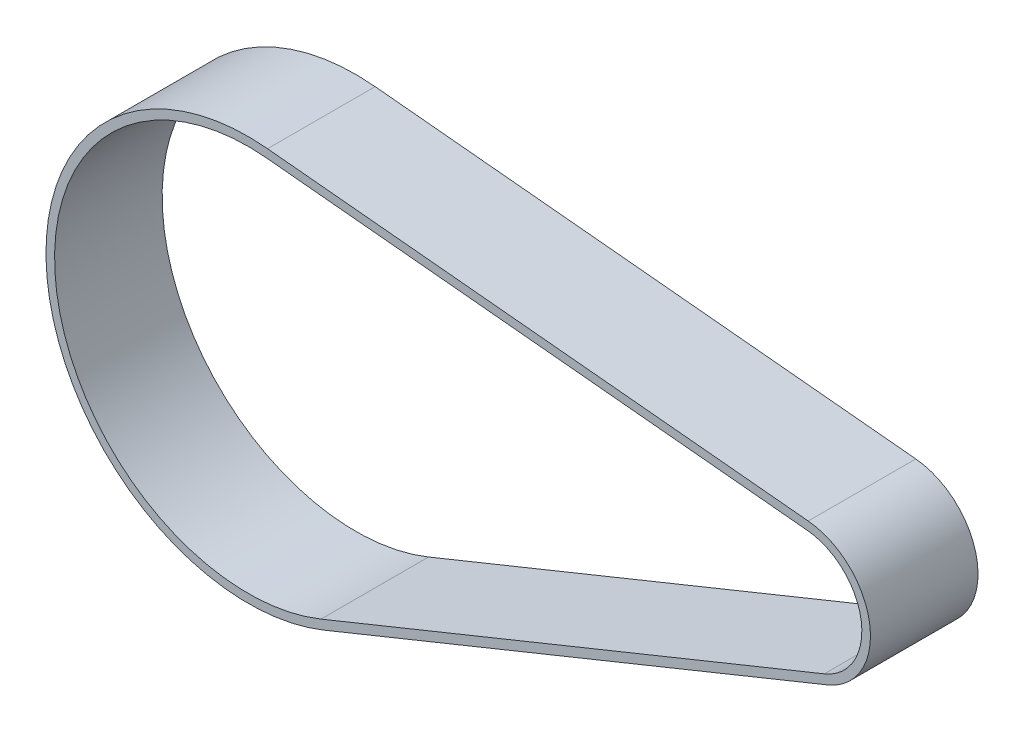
ISO-10303-21;
HEADER;
FILE_DESCRIPTION(('STEP AP214'),'2;1');
FILE_NAME('part.step','',(''),(''),'','','');
FILE_SCHEMA(('AUTOMOTIVE_DESIGN { 1 0 10303 214 1 1 1 1 }'));
ENDSEC;
DATA;
#1=APPLICATION_CONTEXT('core data for automotive mechanical design processes');
#2=APPLICATION_PROTOCOL_DEFINITION('international standard','automotive_design',2000,#1);
#3=PRODUCT_CONTEXT('',#1,'mechanical');
#4=PRODUCT('Part','Part','',(#3));
#5=PRODUCT_RELATED_PRODUCT_CATEGORY('part','',(#4));
#6=PRODUCT_DEFINITION_FORMATION('','',#4);
#7=PRODUCT_DEFINITION_CONTEXT('part definition',#1,'design');
#8=PRODUCT_DEFINITION('design','',#6,#7);
#9=PRODUCT_DEFINITION_SHAPE('','',#8);
#10=(LENGTH_UNIT() NAMED_UNIT(*) SI_UNIT(.MILLI.,.METRE.));
#11=(NAMED_UNIT(*) PLANE_ANGLE_UNIT() SI_UNIT($,.RADIAN.));
#12=(NAMED_UNIT(*) SI_UNIT($,.STERADIAN.) SOLID_ANGLE_UNIT());
#13=UNCERTAINTY_MEASURE_WITH_UNIT(LENGTH_MEASURE(1.E-05),#10,'distance_accuracy_value','');
#14=(GEOMETRIC_REPRESENTATION_CONTEXT(3) GLOBAL_UNCERTAINTY_ASSIGNED_CONTEXT((#13)) GLOBAL_UNIT_ASSIGNED_CONTEXT((#10,
#11,#12)) REPRESENTATION_CONTEXT('',''));
#15=CARTESIAN_POINT('',(0.,0.,0.));
#16=DIRECTION('',(0.,0.,1.));
#17=DIRECTION('',(1.,0.,0.));
#18=AXIS2_PLACEMENT_3D('',#15,#16,#17);
#19=CARTESIAN_POINT('',(0.,0.,-25.));
#20=DIRECTION('',(0.,0.,1.));
#21=DIRECTION('',(1.,0.,0.));
#22=AXIS2_PLACEMENT_3D('',#19,#20,#21);
#23=CYLINDRICAL_SURFACE('',#22,16.);
#24=CARTESIAN_POINT('',(0.,0.,0.));
#25=DIRECTION('',(0.,0.,1.));
#26=DIRECTION('',(1.,0.,0.));
#27=AXIS2_PLACEMENT_3D('',#24,#25,#26);
#28=CIRCLE('',#27,16.);
#29=CARTESIAN_POINT('',(6.01643274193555,-14.8257390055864,0.));
#30=VERTEX_POINT('',#29);
#31=CARTESIAN_POINT('',(1.53456301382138,15.926239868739,0.));
#32=VERTEX_POINT('',#31);
#33=EDGE_CURVE('E156',#30,#32,#28,.T.);
#34=ORIENTED_EDGE('',*,*,#33,.F.);
#35=DIRECTION('',(0.,0.,1.));
#36=VECTOR('',#35,1.);
#37=CARTESIAN_POINT('',(6.01643274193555,-14.8257390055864,-25.));
#38=LINE('',#37,#36);
#39=CARTESIAN_POINT('',(6.01643274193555,-14.8257390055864,-25.));
#40=VERTEX_POINT('',#39);
#41=EDGE_CURVE('E12',#40,#30,#38,.T.);
#42=ORIENTED_EDGE('',*,*,#41,.F.);
#43=CARTESIAN_POINT('',(0.,0.,-25.));
#44=DIRECTION('',(0.,0.,1.));
#45=DIRECTION('',(1.,0.,0.));
#46=AXIS2_PLACEMENT_3D('',#43,#44,#45);
#47=CIRCLE('',#46,16.);
#48=CARTESIAN_POINT('',(1.53456301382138,15.926239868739,-25.));
#49=VERTEX_POINT('',#48);
#50=EDGE_CURVE('E160',#40,#49,#47,.T.);
#51=ORIENTED_EDGE('',*,*,#50,.T.);
#52=DIRECTION('',(0.,0.,1.));
#53=VECTOR('',#52,1.);
#54=CARTESIAN_POINT('',(1.53456301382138,15.926239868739,-25.));
#55=LINE('',#54,#53);
#56=EDGE_CURVE('E61',#49,#32,#55,.T.);
#57=ORIENTED_EDGE('',*,*,#56,.T.);
#58=EDGE_LOOP('',(#34,#42,#51,#57));
#59=FACE_BOUND('',#58,.T.);
#60=ADVANCED_FACE('F58',(#59),#23,.T.);
#61=CARTESIAN_POINT('',(6.01643274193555,-14.8257390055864,-25.));
#62=DIRECTION('',(0.376027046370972,-0.92660868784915,0.));
#63=DIRECTION('',(0.92660868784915,0.376027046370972,0.));
#64=AXIS2_PLACEMENT_3D('',#61,#62,#63);
#65=PLANE('',#64);
#66=DIRECTION('',(0.92660868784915,0.376027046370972,0.));
#67=VECTOR('',#66,1.);
#68=CARTESIAN_POINT('',(6.01643274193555,-14.8257390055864,0.));
#69=LINE('',#68,#67);
#70=CARTESIAN_POINT('',(-110.967684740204,-62.2990605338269,0.));
#71=VERTEX_POINT('',#70);
#72=EDGE_CURVE('E164',#71,#30,#69,.T.);
#73=ORIENTED_EDGE('',*,*,#72,.F.);
#74=DIRECTION('',(0.,0.,1.));
#75=VECTOR('',#74,1.);
#76=CARTESIAN_POINT('',(-110.967684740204,-62.2990605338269,-25.));
#77=LINE('',#76,#75);
#78=CARTESIAN_POINT('',(-110.967684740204,-62.2990605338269,-25.));
#79=VERTEX_POINT('',#78);
#80=EDGE_CURVE('E66',#79,#71,#77,.T.);
#81=ORIENTED_EDGE('',*,*,#80,.F.);
#82=DIRECTION('',(0.92660868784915,0.376027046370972,0.));
#83=VECTOR('',#82,1.);
#84=CARTESIAN_POINT('',(6.01643274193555,-14.8257390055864,-25.));
#85=LINE('',#84,#83);
#86=EDGE_CURVE('E170',#79,#40,#85,.T.);
#87=ORIENTED_EDGE('',*,*,#86,.T.);
#88=ORIENTED_EDGE('',*,*,#41,.T.);
#89=EDGE_LOOP('',(#73,#81,#87,#88));
#90=FACE_BOUND('',#89,.T.);
#91=ADVANCED_FACE('F196',(#90),#65,.T.);
#92=CARTESIAN_POINT('',(-128.64095591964,-18.7484522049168,-25.));
#93=DIRECTION('',(0.,0.,1.));
#94=DIRECTION('',(1.,0.,0.));
#95=AXIS2_PLACEMENT_3D('',#92,#93,#94);
#96=CYLINDRICAL_SURFACE('',#95,47.);
#97=CARTESIAN_POINT('',(-128.64095591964,-18.7484522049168,0.));
#98=DIRECTION('',(0.,0.,1.));
#99=DIRECTION('',(1.,0.,0.));
#100=AXIS2_PLACEMENT_3D('',#97,#98,#99);
#101=CIRCLE('',#100,47.);
#102=CARTESIAN_POINT('',(-124.133177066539,28.034877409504,0.));
#103=VERTEX_POINT('',#102);
#104=EDGE_CURVE('E178',#103,#71,#101,.T.);
#105=ORIENTED_EDGE('',*,*,#104,.F.);
#106=DIRECTION('',(0.,0.,1.));
#107=VECTOR('',#106,1.);
#108=CARTESIAN_POINT('',(-124.133177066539,28.034877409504,-25.));
#109=LINE('',#108,#107);
#110=CARTESIAN_POINT('',(-124.133177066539,28.034877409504,-25.));
#111=VERTEX_POINT('',#110);
#112=EDGE_CURVE('E183',#111,#103,#109,.T.);
#113=ORIENTED_EDGE('',*,*,#112,.F.);
#114=CARTESIAN_POINT('',(-128.64095591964,-18.7484522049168,-25.));
#115=DIRECTION('',(0.,0.,1.));
#116=DIRECTION('',(1.,0.,0.));
#117=AXIS2_PLACEMENT_3D('',#114,#115,#116);
#118=CIRCLE('',#117,47.);
#119=EDGE_CURVE('E167',#111,#79,#118,.T.);
#120=ORIENTED_EDGE('',*,*,#119,.T.);
#121=ORIENTED_EDGE('',*,*,#80,.T.);
#122=EDGE_LOOP('',(#105,#113,#120,#121));
#123=FACE_BOUND('',#122,.T.);
#124=ADVANCED_FACE('F200',(#123),#96,.T.);
#125=CARTESIAN_POINT('',(1.53456301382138,15.926239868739,-25.));
#126=DIRECTION('',(0.0959101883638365,0.995389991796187,0.));
#127=DIRECTION('',(-0.995389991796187,0.0959101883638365,0.));
#128=AXIS2_PLACEMENT_3D('',#125,#126,#127);
#129=PLANE('',#128);
#130=DIRECTION('',(-0.995389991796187,0.0959101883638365,0.));
#131=VECTOR('',#130,1.);
#132=CARTESIAN_POINT('',(1.53456301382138,15.926239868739,0.));
#133=LINE('',#132,#131);
#134=EDGE_CURVE('E175',#32,#103,#133,.T.);
#135=ORIENTED_EDGE('',*,*,#134,.F.);
#136=ORIENTED_EDGE('',*,*,#56,.F.);
#137=DIRECTION('',(-0.995389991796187,0.0959101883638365,0.));
#138=VECTOR('',#137,1.);
#139=CARTESIAN_POINT('',(1.53456301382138,15.926239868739,-25.));
#140=LINE('',#139,#138);
#141=EDGE_CURVE('E163',#49,#111,#140,.T.);
#142=ORIENTED_EDGE('',*,*,#141,.T.);
#143=ORIENTED_EDGE('',*,*,#112,.T.);
#144=EDGE_LOOP('',(#135,#136,#142,#143));
#145=FACE_BOUND('',#144,.T.);
#146=ADVANCED_FACE('F191',(#145),#129,.T.);
#147=CARTESIAN_POINT('',(0.,0.,-25.));
#148=DIRECTION('',(0.,0.,1.));
#149=DIRECTION('',(1.,0.,0.));
#150=AXIS2_PLACEMENT_3D('',#147,#148,#149);
#151=PLANE('',#150);
#152=DIRECTION('',(0.92660868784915,0.376027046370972,0.));
#153=VECTOR('',#152,1.);
#154=CARTESIAN_POINT('',(5.2643786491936,-12.9725216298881,-25.));
#155=LINE('',#154,#153);
#156=CARTESIAN_POINT('',(-111.719738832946,-60.4458431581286,-25.));
#157=VERTEX_POINT('',#156);
#158=CARTESIAN_POINT('',(5.2643786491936,-12.9725216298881,-25.));
#159=VERTEX_POINT('',#158);
#160=EDGE_CURVE('E131',#157,#159,#155,.T.);
#161=ORIENTED_EDGE('',*,*,#160,.T.);
#162=CARTESIAN_POINT('',(0.,0.,-25.));
#163=DIRECTION('',(0.,0.,1.));
#164=DIRECTION('',(1.,0.,0.));
#165=AXIS2_PLACEMENT_3D('',#162,#163,#164);
#166=CIRCLE('',#165,14.);
#167=CARTESIAN_POINT('',(1.34274263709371,13.9354598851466,-25.));
#168=VERTEX_POINT('',#167);
#169=EDGE_CURVE('E125',#159,#168,#166,.T.);
#170=ORIENTED_EDGE('',*,*,#169,.T.);
#171=DIRECTION('',(-0.995389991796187,0.0959101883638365,0.));
#172=VECTOR('',#171,1.);
#173=CARTESIAN_POINT('',(1.34274263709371,13.9354598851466,-25.));
#174=LINE('',#173,#172);
#175=CARTESIAN_POINT('',(-124.324997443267,26.0440974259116,-25.));
#176=VERTEX_POINT('',#175);
#177=EDGE_CURVE('E134',#168,#176,#174,.T.);
#178=ORIENTED_EDGE('',*,*,#177,.T.);
#179=CARTESIAN_POINT('',(-128.64095591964,-18.7484522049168,-25.));
#180=DIRECTION('',(0.,0.,1.));
#181=DIRECTION('',(1.,0.,0.));
#182=AXIS2_PLACEMENT_3D('',#179,#180,#181);
#183=CIRCLE('',#182,45.);
#184=EDGE_CURVE('E74',#176,#157,#183,.T.);
#185=ORIENTED_EDGE('',*,*,#184,.T.);
#186=EDGE_LOOP('',(#161,#170,#178,#185));
#187=FACE_BOUND('',#186,.T.);
#188=ORIENTED_EDGE('',*,*,#50,.F.);
#189=ORIENTED_EDGE('',*,*,#86,.F.);
#190=ORIENTED_EDGE('',*,*,#119,.F.);
#191=ORIENTED_EDGE('',*,*,#141,.F.);
#192=EDGE_LOOP('',(#188,#189,#190,#191));
#193=FACE_BOUND('',#192,.T.);
#194=ADVANCED_FACE('F138',(#187,#193),#151,.F.);
#195=CARTESIAN_POINT('',(0.,0.,0.));
#196=DIRECTION('',(0.,0.,1.));
#197=DIRECTION('',(1.,0.,0.));
#198=AXIS2_PLACEMENT_3D('',#195,#196,#197);
#199=PLANE('',#198);
#200=CARTESIAN_POINT('',(0.,0.,0.));
#201=DIRECTION('',(0.,0.,1.));
#202=DIRECTION('',(1.,0.,0.));
#203=AXIS2_PLACEMENT_3D('',#200,#201,#202);
#204=CIRCLE('',#203,14.);
#205=CARTESIAN_POINT('',(5.2643786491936,-12.9725216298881,0.));
#206=VERTEX_POINT('',#205);
#207=CARTESIAN_POINT('',(1.34274263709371,13.9354598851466,0.));
#208=VERTEX_POINT('',#207);
#209=EDGE_CURVE('E82',#206,#208,#204,.T.);
#210=ORIENTED_EDGE('',*,*,#209,.F.);
#211=DIRECTION('',(0.92660868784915,0.376027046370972,0.));
#212=VECTOR('',#211,1.);
#213=CARTESIAN_POINT('',(5.2643786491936,-12.9725216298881,0.));
#214=LINE('',#213,#212);
#215=CARTESIAN_POINT('',(-111.719738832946,-60.4458431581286,0.));
#216=VERTEX_POINT('',#215);
#217=EDGE_CURVE('E141',#216,#206,#214,.T.);
#218=ORIENTED_EDGE('',*,*,#217,.F.);
#219=CARTESIAN_POINT('',(-128.64095591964,-18.7484522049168,0.));
#220=DIRECTION('',(0.,0.,1.));
#221=DIRECTION('',(1.,0.,0.));
#222=AXIS2_PLACEMENT_3D('',#219,#220,#221);
#223=CIRCLE('',#222,45.);
#224=CARTESIAN_POINT('',(-124.324997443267,26.0440974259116,0.));
#225=VERTEX_POINT('',#224);
#226=EDGE_CURVE('E144',#225,#216,#223,.T.);
#227=ORIENTED_EDGE('',*,*,#226,.F.);
#228=DIRECTION('',(-0.995389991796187,0.0959101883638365,0.));
#229=VECTOR('',#228,1.);
#230=CARTESIAN_POINT('',(1.34274263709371,13.9354598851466,0.));
#231=LINE('',#230,#229);
#232=EDGE_CURVE('E150',#208,#225,#231,.T.);
#233=ORIENTED_EDGE('',*,*,#232,.F.);
#234=EDGE_LOOP('',(#210,#218,#227,#233));
#235=FACE_BOUND('',#234,.T.);
#236=ORIENTED_EDGE('',*,*,#33,.T.);
#237=ORIENTED_EDGE('',*,*,#134,.T.);
#238=ORIENTED_EDGE('',*,*,#104,.T.);
#239=ORIENTED_EDGE('',*,*,#72,.T.);
#240=EDGE_LOOP('',(#236,#237,#238,#239));
#241=FACE_BOUND('',#240,.T.);
#242=ADVANCED_FACE('F193',(#235,#241),#199,.T.);
#243=CARTESIAN_POINT('',(0.,0.,-25.));
#244=DIRECTION('',(0.,0.,1.));
#245=DIRECTION('',(1.,0.,0.));
#246=AXIS2_PLACEMENT_3D('',#243,#244,#245);
#247=CYLINDRICAL_SURFACE('',#246,14.);
#248=ORIENTED_EDGE('',*,*,#209,.T.);
#249=DIRECTION('',(0.,0.,1.));
#250=VECTOR('',#249,1.);
#251=CARTESIAN_POINT('',(1.34274263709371,13.9354598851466,-25.));
#252=LINE('',#251,#250);
#253=EDGE_CURVE('E121',#168,#208,#252,.T.);
#254=ORIENTED_EDGE('',*,*,#253,.F.);
#255=ORIENTED_EDGE('',*,*,#169,.F.);
#256=DIRECTION('',(0.,0.,1.));
#257=VECTOR('',#256,1.);
#258=CARTESIAN_POINT('',(5.2643786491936,-12.9725216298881,-25.));
#259=LINE('',#258,#257);
#260=EDGE_CURVE('E154',#159,#206,#259,.T.);
#261=ORIENTED_EDGE('',*,*,#260,.T.);
#262=EDGE_LOOP('',(#248,#254,#255,#261));
#263=FACE_BOUND('',#262,.T.);
#264=ADVANCED_FACE('F123',(#263),#247,.F.);
#265=CARTESIAN_POINT('',(5.2643786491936,-12.9725216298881,-25.));
#266=DIRECTION('',(0.376027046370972,-0.92660868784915,0.));
#267=DIRECTION('',(0.92660868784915,0.376027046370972,0.));
#268=AXIS2_PLACEMENT_3D('',#265,#266,#267);
#269=PLANE('',#268);
#270=ORIENTED_EDGE('',*,*,#217,.T.);
#271=ORIENTED_EDGE('',*,*,#260,.F.);
#272=ORIENTED_EDGE('',*,*,#160,.F.);
#273=DIRECTION('',(0.,0.,1.));
#274=VECTOR('',#273,1.);
#275=CARTESIAN_POINT('',(-111.719738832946,-60.4458431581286,-25.));
#276=LINE('',#275,#274);
#277=EDGE_CURVE('E157',#157,#216,#276,.T.);
#278=ORIENTED_EDGE('',*,*,#277,.T.);
#279=EDGE_LOOP('',(#270,#271,#272,#278));
#280=FACE_BOUND('',#279,.T.);
#281=ADVANCED_FACE('F251',(#280),#269,.F.);
#282=CARTESIAN_POINT('',(-128.64095591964,-18.7484522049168,-25.));
#283=DIRECTION('',(0.,0.,1.));
#284=DIRECTION('',(1.,0.,0.));
#285=AXIS2_PLACEMENT_3D('',#282,#283,#284);
#286=CYLINDRICAL_SURFACE('',#285,45.);
#287=ORIENTED_EDGE('',*,*,#226,.T.);
#288=ORIENTED_EDGE('',*,*,#277,.F.);
#289=ORIENTED_EDGE('',*,*,#184,.F.);
#290=DIRECTION('',(0.,0.,1.));
#291=VECTOR('',#290,1.);
#292=CARTESIAN_POINT('',(-124.324997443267,26.0440974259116,-25.));
#293=LINE('',#292,#291);
#294=EDGE_CURVE('E130',#176,#225,#293,.T.);
#295=ORIENTED_EDGE('',*,*,#294,.T.);
#296=EDGE_LOOP('',(#287,#288,#289,#295));
#297=FACE_BOUND('',#296,.T.);
#298=ADVANCED_FACE('F260',(#297),#286,.F.);
#299=CARTESIAN_POINT('',(1.34274263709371,13.9354598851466,-25.));
#300=DIRECTION('',(0.0959101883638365,0.995389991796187,0.));
#301=DIRECTION('',(-0.995389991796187,0.0959101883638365,0.));
#302=AXIS2_PLACEMENT_3D('',#299,#300,#301);
#303=PLANE('',#302);
#304=ORIENTED_EDGE('',*,*,#232,.T.);
#305=ORIENTED_EDGE('',*,*,#294,.F.);
#306=ORIENTED_EDGE('',*,*,#177,.F.);
#307=ORIENTED_EDGE('',*,*,#253,.T.);
#308=EDGE_LOOP('',(#304,#305,#306,#307));
#309=FACE_BOUND('',#308,.T.);
#310=ADVANCED_FACE('F135',(#309),#303,.F.);
#311=CLOSED_SHELL('',(#60,#91,#124,#146,#194,#242,#264,#281,#298,#310));
#312=MANIFOLD_SOLID_BREP('B2',#311);
#313=ADVANCED_BREP_SHAPE_REPRESENTATION('',(#18,#312),#14);
#314=SHAPE_DEFINITION_REPRESENTATION(#9,#313);
ENDSEC;
END-ISO-10303-21;
